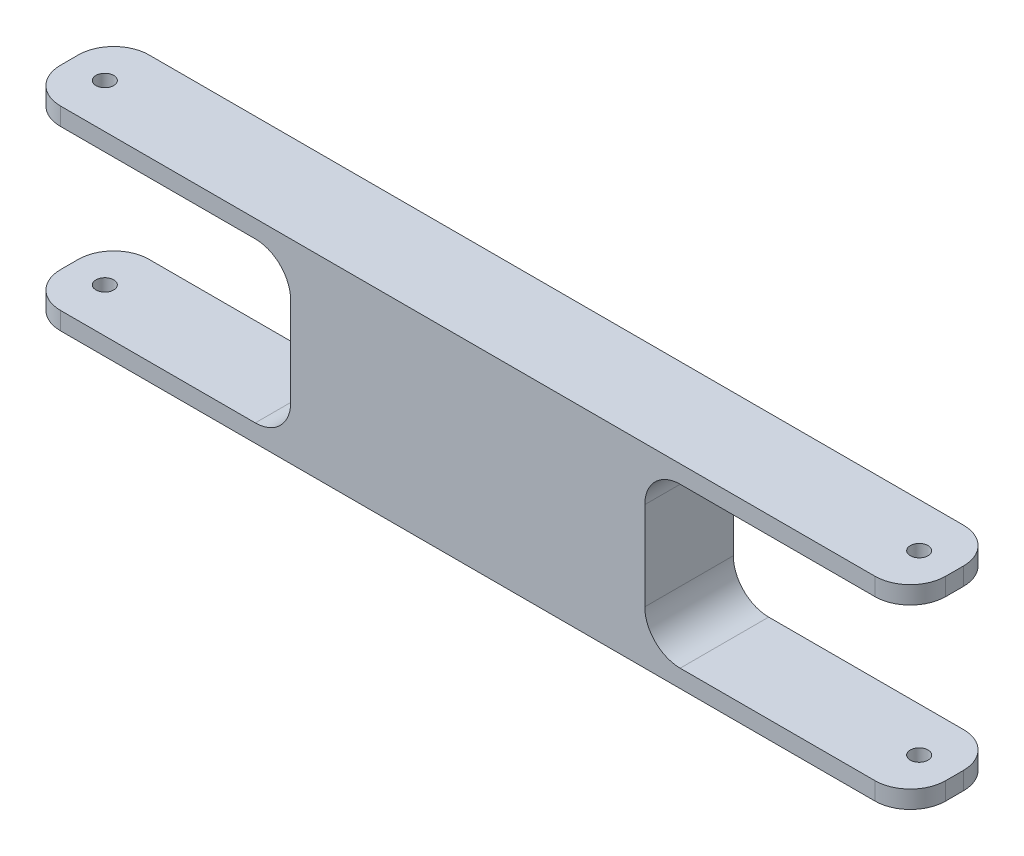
ISO-10303-21;
HEADER;
FILE_DESCRIPTION(('STEP AP214'),'2;1');
FILE_NAME('part.step','',(''),(''),'','','');
FILE_SCHEMA(('AUTOMOTIVE_DESIGN { 1 0 10303 214 1 1 1 1 }'));
ENDSEC;
DATA;
#1=APPLICATION_CONTEXT('core data for automotive mechanical design processes');
#2=APPLICATION_PROTOCOL_DEFINITION('international standard','automotive_design',2000,#1);
#3=PRODUCT_CONTEXT('',#1,'mechanical');
#4=PRODUCT('Part','Part','',(#3));
#5=PRODUCT_RELATED_PRODUCT_CATEGORY('part','',(#4));
#6=PRODUCT_DEFINITION_FORMATION('','',#4);
#7=PRODUCT_DEFINITION_CONTEXT('part definition',#1,'design');
#8=PRODUCT_DEFINITION('design','',#6,#7);
#9=PRODUCT_DEFINITION_SHAPE('','',#8);
#10=(LENGTH_UNIT() NAMED_UNIT(*) SI_UNIT(.MILLI.,.METRE.));
#11=(NAMED_UNIT(*) PLANE_ANGLE_UNIT() SI_UNIT($,.RADIAN.));
#12=(NAMED_UNIT(*) SI_UNIT($,.STERADIAN.) SOLID_ANGLE_UNIT());
#13=UNCERTAINTY_MEASURE_WITH_UNIT(LENGTH_MEASURE(1.E-05),#10,'distance_accuracy_value','');
#14=(GEOMETRIC_REPRESENTATION_CONTEXT(3) GLOBAL_UNCERTAINTY_ASSIGNED_CONTEXT((#13)) GLOBAL_UNIT_ASSIGNED_CONTEXT((#10,
#11,#12)) REPRESENTATION_CONTEXT('',''));
#15=CARTESIAN_POINT('',(0.,0.,0.));
#16=DIRECTION('',(0.,0.,1.));
#17=DIRECTION('',(1.,0.,0.));
#18=AXIS2_PLACEMENT_3D('',#15,#16,#17);
#19=CARTESIAN_POINT('',(-125.,-27.5,25.));
#20=DIRECTION('',(1.,0.,0.));
#21=DIRECTION('',(0.,0.,-1.));
#22=AXIS2_PLACEMENT_3D('',#19,#20,#21);
#23=PLANE('',#22);
#24=DIRECTION('',(0.,0.,1.));
#25=VECTOR('',#24,1.);
#26=CARTESIAN_POINT('',(-125.,22.5,-5.));
#27=LINE('',#26,#25);
#28=CARTESIAN_POINT('',(-125.,22.5,10.));
#29=VERTEX_POINT('',#28);
#30=CARTESIAN_POINT('',(-125.,22.5,15.));
#31=VERTEX_POINT('',#30);
#32=EDGE_CURVE('E249',#29,#31,#27,.T.);
#33=ORIENTED_EDGE('',*,*,#32,.T.);
#34=DIRECTION('',(0.,-1.,0.));
#35=VECTOR('',#34,1.);
#36=CARTESIAN_POINT('',(-125.,27.5,15.));
#37=LINE('',#36,#35);
#38=CARTESIAN_POINT('',(-125.,27.5,15.));
#39=VERTEX_POINT('',#38);
#40=EDGE_CURVE('E386',#31,#39,#37,.F.);
#41=ORIENTED_EDGE('',*,*,#40,.T.);
#42=DIRECTION('',(0.,0.,-1.));
#43=VECTOR('',#42,1.);
#44=CARTESIAN_POINT('',(-125.,27.5,25.));
#45=LINE('',#44,#43);
#46=CARTESIAN_POINT('',(-125.,27.5,10.));
#47=VERTEX_POINT('',#46);
#48=EDGE_CURVE('E266',#39,#47,#45,.T.);
#49=ORIENTED_EDGE('',*,*,#48,.T.);
#50=DIRECTION('',(0.,-1.,0.));
#51=VECTOR('',#50,1.);
#52=CARTESIAN_POINT('',(-125.,-27.5,10.));
#53=LINE('',#52,#51);
#54=EDGE_CURVE('E383',#47,#29,#53,.T.);
#55=ORIENTED_EDGE('',*,*,#54,.T.);
#56=EDGE_LOOP('',(#33,#41,#49,#55));
#57=FACE_BOUND('',#56,.T.);
#58=ADVANCED_FACE('F41',(#57),#23,.F.);
#59=CARTESIAN_POINT('',(125.,-27.5,25.));
#60=DIRECTION('',(-1.,0.,0.));
#61=DIRECTION('',(0.,0.,1.));
#62=AXIS2_PLACEMENT_3D('',#59,#60,#61);
#63=PLANE('',#62);
#64=DIRECTION('',(0.,0.,-1.));
#65=VECTOR('',#64,1.);
#66=CARTESIAN_POINT('',(125.,-27.5,25.));
#67=LINE('',#66,#65);
#68=CARTESIAN_POINT('',(125.,-27.5,15.));
#69=VERTEX_POINT('',#68);
#70=CARTESIAN_POINT('',(125.,-27.5,10.));
#71=VERTEX_POINT('',#70);
#72=EDGE_CURVE('E276',#69,#71,#67,.T.);
#73=ORIENTED_EDGE('',*,*,#72,.T.);
#74=DIRECTION('',(0.,1.,0.));
#75=VECTOR('',#74,1.);
#76=CARTESIAN_POINT('',(125.,-27.5,10.));
#77=LINE('',#76,#75);
#78=CARTESIAN_POINT('',(125.,-22.5,10.));
#79=VERTEX_POINT('',#78);
#80=EDGE_CURVE('E364',#71,#79,#77,.T.);
#81=ORIENTED_EDGE('',*,*,#80,.T.);
#82=DIRECTION('',(0.,0.,1.));
#83=VECTOR('',#82,1.);
#84=CARTESIAN_POINT('',(125.,-22.5,-5.));
#85=LINE('',#84,#83);
#86=CARTESIAN_POINT('',(125.,-22.5,15.));
#87=VERTEX_POINT('',#86);
#88=EDGE_CURVE('E237',#79,#87,#85,.T.);
#89=ORIENTED_EDGE('',*,*,#88,.T.);
#90=DIRECTION('',(0.,1.,0.));
#91=VECTOR('',#90,1.);
#92=CARTESIAN_POINT('',(125.,-27.5,15.));
#93=LINE('',#92,#91);
#94=EDGE_CURVE('E362',#87,#69,#93,.F.);
#95=ORIENTED_EDGE('',*,*,#94,.T.);
#96=EDGE_LOOP('',(#73,#81,#89,#95));
#97=FACE_BOUND('',#96,.T.);
#98=ADVANCED_FACE('F444',(#97),#63,.F.);
#99=DIRECTION('',(0.,0.,1.));
#100=VECTOR('',#99,1.);
#101=CARTESIAN_POINT('',(-125.,-22.5,-5.));
#102=LINE('',#101,#100);
#103=CARTESIAN_POINT('',(-125.,-22.5,10.));
#104=VERTEX_POINT('',#103);
#105=CARTESIAN_POINT('',(-125.,-22.5,15.));
#106=VERTEX_POINT('',#105);
#107=EDGE_CURVE('E246',#104,#106,#102,.T.);
#108=ORIENTED_EDGE('',*,*,#107,.F.);
#109=DIRECTION('',(0.,-1.,0.));
#110=VECTOR('',#109,1.);
#111=CARTESIAN_POINT('',(-125.,-27.5,10.));
#112=LINE('',#111,#110);
#113=CARTESIAN_POINT('',(-125.,-27.5,10.));
#114=VERTEX_POINT('',#113);
#115=EDGE_CURVE('E389',#104,#114,#112,.T.);
#116=ORIENTED_EDGE('',*,*,#115,.T.);
#117=DIRECTION('',(0.,0.,-1.));
#118=VECTOR('',#117,1.);
#119=CARTESIAN_POINT('',(-125.,-27.5,25.));
#120=LINE('',#119,#118);
#121=CARTESIAN_POINT('',(-125.,-27.5,15.));
#122=VERTEX_POINT('',#121);
#123=EDGE_CURVE('E279',#122,#114,#120,.T.);
#124=ORIENTED_EDGE('',*,*,#123,.F.);
#125=DIRECTION('',(0.,-1.,0.));
#126=VECTOR('',#125,1.);
#127=CARTESIAN_POINT('',(-125.,-22.5,15.));
#128=LINE('',#127,#126);
#129=EDGE_CURVE('E58',#122,#106,#128,.F.);
#130=ORIENTED_EDGE('',*,*,#129,.T.);
#131=EDGE_LOOP('',(#108,#116,#124,#130));
#132=FACE_BOUND('',#131,.T.);
#133=ADVANCED_FACE('F447',(#132),#23,.F.);
#134=CARTESIAN_POINT('',(125.,-27.5,25.));
#135=DIRECTION('',(0.,1.,0.));
#136=DIRECTION('',(-1.,0.,0.));
#137=AXIS2_PLACEMENT_3D('',#134,#135,#136);
#138=PLANE('',#137);
#139=CARTESIAN_POINT('',(115.,-27.5,12.5));
#140=DIRECTION('',(0.,-1.,0.));
#141=DIRECTION('',(1.,0.,0.));
#142=AXIS2_PLACEMENT_3D('',#139,#140,#141);
#143=CIRCLE('',#142,2.49999999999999);
#144=CARTESIAN_POINT('',(117.5,-27.5,12.5));
#145=VERTEX_POINT('',#144);
#146=EDGE_CURVE('E401',#145,#145,#143,.T.);
#147=ORIENTED_EDGE('',*,*,#146,.F.);
#148=EDGE_LOOP('',(#147));
#149=FACE_BOUND('',#148,.T.);
#150=CARTESIAN_POINT('',(-115.,-27.5,12.5));
#151=DIRECTION('',(0.,-1.,0.));
#152=DIRECTION('',(-1.,0.,0.));
#153=AXIS2_PLACEMENT_3D('',#150,#151,#152);
#154=CIRCLE('',#153,2.49999999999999);
#155=CARTESIAN_POINT('',(-117.5,-27.5,12.5));
#156=VERTEX_POINT('',#155);
#157=EDGE_CURVE('E406',#156,#156,#154,.T.);
#158=ORIENTED_EDGE('',*,*,#157,.F.);
#159=EDGE_LOOP('',(#158));
#160=FACE_BOUND('',#159,.T.);
#161=DIRECTION('',(1.,0.,0.));
#162=VECTOR('',#161,1.);
#163=CARTESIAN_POINT('',(125.,-27.5,0.));
#164=LINE('',#163,#162);
#165=CARTESIAN_POINT('',(-115.,-27.5,0.));
#166=VERTEX_POINT('',#165);
#167=CARTESIAN_POINT('',(115.,-27.5,0.));
#168=VERTEX_POINT('',#167);
#169=EDGE_CURVE('E244',#166,#168,#164,.T.);
#170=ORIENTED_EDGE('',*,*,#169,.T.);
#171=CARTESIAN_POINT('',(115.,-27.5,10.));
#172=DIRECTION('',(0.,1.,0.));
#173=DIRECTION('',(-1.,0.,0.));
#174=AXIS2_PLACEMENT_3D('',#171,#172,#173);
#175=CIRCLE('',#174,10.);
#176=EDGE_CURVE('E377',#168,#71,#175,.F.);
#177=ORIENTED_EDGE('',*,*,#176,.T.);
#178=ORIENTED_EDGE('',*,*,#72,.F.);
#179=CARTESIAN_POINT('',(115.,-27.5,15.));
#180=DIRECTION('',(0.,1.,0.));
#181=DIRECTION('',(-1.,0.,0.));
#182=AXIS2_PLACEMENT_3D('',#179,#180,#181);
#183=CIRCLE('',#182,10.);
#184=CARTESIAN_POINT('',(115.,-27.5,25.));
#185=VERTEX_POINT('',#184);
#186=EDGE_CURVE('E375',#69,#185,#183,.F.);
#187=ORIENTED_EDGE('',*,*,#186,.T.);
#188=DIRECTION('',(1.,0.,0.));
#189=VECTOR('',#188,1.);
#190=CARTESIAN_POINT('',(125.,-27.5,25.));
#191=LINE('',#190,#189);
#192=CARTESIAN_POINT('',(-115.,-27.5,25.));
#193=VERTEX_POINT('',#192);
#194=EDGE_CURVE('E260',#193,#185,#191,.T.);
#195=ORIENTED_EDGE('',*,*,#194,.F.);
#196=CARTESIAN_POINT('',(-115.,-27.5,15.));
#197=DIRECTION('',(0.,1.,0.));
#198=DIRECTION('',(-1.,0.,0.));
#199=AXIS2_PLACEMENT_3D('',#196,#197,#198);
#200=CIRCLE('',#199,10.);
#201=EDGE_CURVE('E371',#193,#122,#200,.F.);
#202=ORIENTED_EDGE('',*,*,#201,.T.);
#203=ORIENTED_EDGE('',*,*,#123,.T.);
#204=CARTESIAN_POINT('',(-115.,-27.5,10.));
#205=DIRECTION('',(0.,1.,0.));
#206=DIRECTION('',(-1.,0.,0.));
#207=AXIS2_PLACEMENT_3D('',#204,#205,#206);
#208=CIRCLE('',#207,10.);
#209=EDGE_CURVE('E373',#114,#166,#208,.F.);
#210=ORIENTED_EDGE('',*,*,#209,.T.);
#211=EDGE_LOOP('',(#170,#177,#178,#187,#195,#202,#203,#210));
#212=FACE_BOUND('',#211,.T.);
#213=ADVANCED_FACE('F458',(#149,#160,#212),#138,.F.);
#214=DIRECTION('',(0.,0.,1.));
#215=VECTOR('',#214,1.);
#216=CARTESIAN_POINT('',(125.,22.5,-5.));
#217=LINE('',#216,#215);
#218=CARTESIAN_POINT('',(125.,22.5,10.));
#219=VERTEX_POINT('',#218);
#220=CARTESIAN_POINT('',(125.,22.5,15.));
#221=VERTEX_POINT('',#220);
#222=EDGE_CURVE('E233',#219,#221,#217,.T.);
#223=ORIENTED_EDGE('',*,*,#222,.F.);
#224=DIRECTION('',(0.,1.,0.));
#225=VECTOR('',#224,1.);
#226=CARTESIAN_POINT('',(125.,-27.5,10.));
#227=LINE('',#226,#225);
#228=CARTESIAN_POINT('',(125.,27.5,10.));
#229=VERTEX_POINT('',#228);
#230=EDGE_CURVE('E329',#219,#229,#227,.T.);
#231=ORIENTED_EDGE('',*,*,#230,.T.);
#232=DIRECTION('',(0.,0.,-1.));
#233=VECTOR('',#232,1.);
#234=CARTESIAN_POINT('',(125.,27.5,25.));
#235=LINE('',#234,#233);
#236=CARTESIAN_POINT('',(125.,27.5,15.));
#237=VERTEX_POINT('',#236);
#238=EDGE_CURVE('E273',#237,#229,#235,.T.);
#239=ORIENTED_EDGE('',*,*,#238,.F.);
#240=DIRECTION('',(0.,1.,0.));
#241=VECTOR('',#240,1.);
#242=CARTESIAN_POINT('',(125.,22.5,15.));
#243=LINE('',#242,#241);
#244=EDGE_CURVE('E327',#237,#221,#243,.F.);
#245=ORIENTED_EDGE('',*,*,#244,.T.);
#246=EDGE_LOOP('',(#223,#231,#239,#245));
#247=FACE_BOUND('',#246,.T.);
#248=ADVANCED_FACE('F454',(#247),#63,.F.);
#249=CARTESIAN_POINT('',(125.,27.5,25.));
#250=DIRECTION('',(0.,-1.,0.));
#251=DIRECTION('',(1.,0.,0.));
#252=AXIS2_PLACEMENT_3D('',#249,#250,#251);
#253=PLANE('',#252);
#254=CARTESIAN_POINT('',(115.,27.5,12.5));
#255=DIRECTION('',(0.,-1.,0.));
#256=DIRECTION('',(1.,0.,0.));
#257=AXIS2_PLACEMENT_3D('',#254,#255,#256);
#258=CIRCLE('',#257,2.49999999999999);
#259=CARTESIAN_POINT('',(117.5,27.5,12.5));
#260=VERTEX_POINT('',#259);
#261=EDGE_CURVE('E395',#260,#260,#258,.T.);
#262=ORIENTED_EDGE('',*,*,#261,.T.);
#263=EDGE_LOOP('',(#262));
#264=FACE_BOUND('',#263,.T.);
#265=CARTESIAN_POINT('',(-115.,27.5,12.5));
#266=DIRECTION('',(0.,-1.,0.));
#267=DIRECTION('',(-1.,0.,0.));
#268=AXIS2_PLACEMENT_3D('',#265,#266,#267);
#269=CIRCLE('',#268,2.49999999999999);
#270=CARTESIAN_POINT('',(-117.5,27.5,12.5));
#271=VERTEX_POINT('',#270);
#272=EDGE_CURVE('E411',#271,#271,#269,.T.);
#273=ORIENTED_EDGE('',*,*,#272,.T.);
#274=EDGE_LOOP('',(#273));
#275=FACE_BOUND('',#274,.T.);
#276=ORIENTED_EDGE('',*,*,#238,.T.);
#277=CARTESIAN_POINT('',(115.,27.5,10.));
#278=DIRECTION('',(0.,-1.,0.));
#279=DIRECTION('',(1.,0.,0.));
#280=AXIS2_PLACEMENT_3D('',#277,#278,#279);
#281=CIRCLE('',#280,10.);
#282=CARTESIAN_POINT('',(115.,27.5,0.));
#283=VERTEX_POINT('',#282);
#284=EDGE_CURVE('E338',#229,#283,#281,.F.);
#285=ORIENTED_EDGE('',*,*,#284,.T.);
#286=DIRECTION('',(-1.,0.,0.));
#287=VECTOR('',#286,1.);
#288=CARTESIAN_POINT('',(125.,27.5,0.));
#289=LINE('',#288,#287);
#290=CARTESIAN_POINT('',(-115.,27.5,0.));
#291=VERTEX_POINT('',#290);
#292=EDGE_CURVE('E263',#283,#291,#289,.T.);
#293=ORIENTED_EDGE('',*,*,#292,.T.);
#294=CARTESIAN_POINT('',(-115.,27.5,10.));
#295=DIRECTION('',(0.,-1.,0.));
#296=DIRECTION('',(1.,0.,0.));
#297=AXIS2_PLACEMENT_3D('',#294,#295,#296);
#298=CIRCLE('',#297,10.);
#299=EDGE_CURVE('E332',#291,#47,#298,.F.);
#300=ORIENTED_EDGE('',*,*,#299,.T.);
#301=ORIENTED_EDGE('',*,*,#48,.F.);
#302=CARTESIAN_POINT('',(-115.,27.5,15.));
#303=DIRECTION('',(0.,-1.,0.));
#304=DIRECTION('',(1.,0.,0.));
#305=AXIS2_PLACEMENT_3D('',#302,#303,#304);
#306=CIRCLE('',#305,10.);
#307=CARTESIAN_POINT('',(-115.,27.5,25.));
#308=VERTEX_POINT('',#307);
#309=EDGE_CURVE('E334',#39,#308,#306,.F.);
#310=ORIENTED_EDGE('',*,*,#309,.T.);
#311=DIRECTION('',(-1.,0.,0.));
#312=VECTOR('',#311,1.);
#313=CARTESIAN_POINT('',(125.,27.5,25.));
#314=LINE('',#313,#312);
#315=CARTESIAN_POINT('',(115.,27.5,25.));
#316=VERTEX_POINT('',#315);
#317=EDGE_CURVE('E262',#316,#308,#314,.T.);
#318=ORIENTED_EDGE('',*,*,#317,.F.);
#319=CARTESIAN_POINT('',(115.,27.5,15.));
#320=DIRECTION('',(0.,-1.,0.));
#321=DIRECTION('',(1.,0.,0.));
#322=AXIS2_PLACEMENT_3D('',#319,#320,#321);
#323=CIRCLE('',#322,10.);
#324=EDGE_CURVE('E336',#316,#237,#323,.F.);
#325=ORIENTED_EDGE('',*,*,#324,.T.);
#326=EDGE_LOOP('',(#276,#285,#293,#300,#301,#310,#318,#325));
#327=FACE_BOUND('',#326,.T.);
#328=ADVANCED_FACE('F513',(#264,#275,#327),#253,.F.);
#329=CARTESIAN_POINT('',(0.,0.,25.));
#330=DIRECTION('',(0.,0.,1.));
#331=DIRECTION('',(1.,0.,0.));
#332=AXIS2_PLACEMENT_3D('',#329,#330,#331);
#333=PLANE('',#332);
#334=DIRECTION('',(-1.,0.,0.));
#335=VECTOR('',#334,1.);
#336=CARTESIAN_POINT('',(125.,22.5,25.));
#337=LINE('',#336,#335);
#338=CARTESIAN_POINT('',(115.,22.5,25.));
#339=VERTEX_POINT('',#338);
#340=CARTESIAN_POINT('',(60.,22.5,25.));
#341=VERTEX_POINT('',#340);
#342=EDGE_CURVE('E239',#339,#341,#337,.T.);
#343=ORIENTED_EDGE('',*,*,#342,.F.);
#344=DIRECTION('',(0.,1.,0.));
#345=VECTOR('',#344,1.);
#346=CARTESIAN_POINT('',(115.,27.5,25.));
#347=LINE('',#346,#345);
#348=EDGE_CURVE('E359',#339,#316,#347,.T.);
#349=ORIENTED_EDGE('',*,*,#348,.T.);
#350=ORIENTED_EDGE('',*,*,#317,.T.);
#351=DIRECTION('',(0.,-1.,0.));
#352=VECTOR('',#351,1.);
#353=CARTESIAN_POINT('',(-115.,22.5,25.));
#354=LINE('',#353,#352);
#355=CARTESIAN_POINT('',(-115.,22.5,25.));
#356=VERTEX_POINT('',#355);
#357=EDGE_CURVE('E355',#308,#356,#354,.T.);
#358=ORIENTED_EDGE('',*,*,#357,.T.);
#359=DIRECTION('',(-1.,0.,0.));
#360=VECTOR('',#359,1.);
#361=CARTESIAN_POINT('',(-125.,22.5,25.));
#362=LINE('',#361,#360);
#363=CARTESIAN_POINT('',(-60.,22.5,25.));
#364=VERTEX_POINT('',#363);
#365=EDGE_CURVE('E248',#364,#356,#362,.T.);
#366=ORIENTED_EDGE('',*,*,#365,.F.);
#367=CARTESIAN_POINT('',(-60.,12.5,25.));
#368=DIRECTION('',(0.,0.,1.));
#369=DIRECTION('',(1.,0.,0.));
#370=AXIS2_PLACEMENT_3D('',#367,#368,#369);
#371=CIRCLE('',#370,10.);
#372=CARTESIAN_POINT('',(-50.,12.5,25.));
#373=VERTEX_POINT('',#372);
#374=EDGE_CURVE('E323',#364,#373,#371,.F.);
#375=ORIENTED_EDGE('',*,*,#374,.T.);
#376=DIRECTION('',(0.,1.,0.));
#377=VECTOR('',#376,1.);
#378=CARTESIAN_POINT('',(-50.,22.5,25.));
#379=LINE('',#378,#377);
#380=CARTESIAN_POINT('',(-50.,-12.5,25.));
#381=VERTEX_POINT('',#380);
#382=EDGE_CURVE('E255',#381,#373,#379,.T.);
#383=ORIENTED_EDGE('',*,*,#382,.F.);
#384=CARTESIAN_POINT('',(-60.,-12.5,25.));
#385=DIRECTION('',(0.,0.,1.));
#386=DIRECTION('',(1.,0.,0.));
#387=AXIS2_PLACEMENT_3D('',#384,#385,#386);
#388=CIRCLE('',#387,10.);
#389=CARTESIAN_POINT('',(-60.,-22.5,25.));
#390=VERTEX_POINT('',#389);
#391=EDGE_CURVE('E313',#381,#390,#388,.F.);
#392=ORIENTED_EDGE('',*,*,#391,.T.);
#393=DIRECTION('',(1.,0.,0.));
#394=VECTOR('',#393,1.);
#395=CARTESIAN_POINT('',(-125.,-22.5,25.));
#396=LINE('',#395,#394);
#397=CARTESIAN_POINT('',(-115.,-22.5,25.));
#398=VERTEX_POINT('',#397);
#399=EDGE_CURVE('E258',#398,#390,#396,.T.);
#400=ORIENTED_EDGE('',*,*,#399,.F.);
#401=DIRECTION('',(0.,-1.,0.));
#402=VECTOR('',#401,1.);
#403=CARTESIAN_POINT('',(-115.,-27.5,25.));
#404=LINE('',#403,#402);
#405=EDGE_CURVE('E352',#398,#193,#404,.T.);
#406=ORIENTED_EDGE('',*,*,#405,.T.);
#407=ORIENTED_EDGE('',*,*,#194,.T.);
#408=DIRECTION('',(0.,1.,0.));
#409=VECTOR('',#408,1.);
#410=CARTESIAN_POINT('',(115.,-22.5,25.));
#411=LINE('',#410,#409);
#412=CARTESIAN_POINT('',(115.,-22.5,25.));
#413=VERTEX_POINT('',#412);
#414=EDGE_CURVE('E232',#185,#413,#411,.T.);
#415=ORIENTED_EDGE('',*,*,#414,.T.);
#416=DIRECTION('',(1.,0.,0.));
#417=VECTOR('',#416,1.);
#418=CARTESIAN_POINT('',(125.,-22.5,25.));
#419=LINE('',#418,#417);
#420=CARTESIAN_POINT('',(60.,-22.5,25.));
#421=VERTEX_POINT('',#420);
#422=EDGE_CURVE('E222',#421,#413,#419,.T.);
#423=ORIENTED_EDGE('',*,*,#422,.F.);
#424=CARTESIAN_POINT('',(60.,-12.5,25.));
#425=DIRECTION('',(0.,0.,1.));
#426=DIRECTION('',(1.,0.,0.));
#427=AXIS2_PLACEMENT_3D('',#424,#425,#426);
#428=CIRCLE('',#427,10.);
#429=CARTESIAN_POINT('',(50.,-12.5,25.));
#430=VERTEX_POINT('',#429);
#431=EDGE_CURVE('E204',#421,#430,#428,.F.);
#432=ORIENTED_EDGE('',*,*,#431,.T.);
#433=DIRECTION('',(0.,-1.,0.));
#434=VECTOR('',#433,1.);
#435=CARTESIAN_POINT('',(50.,22.5,25.));
#436=LINE('',#435,#434);
#437=CARTESIAN_POINT('',(50.,12.5,25.));
#438=VERTEX_POINT('',#437);
#439=EDGE_CURVE('E234',#438,#430,#436,.T.);
#440=ORIENTED_EDGE('',*,*,#439,.F.);
#441=CARTESIAN_POINT('',(60.,12.5,25.));
#442=DIRECTION('',(0.,0.,1.));
#443=DIRECTION('',(1.,0.,0.));
#444=AXIS2_PLACEMENT_3D('',#441,#442,#443);
#445=CIRCLE('',#444,10.);
#446=EDGE_CURVE('E318',#438,#341,#445,.F.);
#447=ORIENTED_EDGE('',*,*,#446,.T.);
#448=EDGE_LOOP('',(#343,#349,#350,#358,#366,#375,#383,#392,#400,#406,#407,#415,#423,#432,#440,#447));
#449=FACE_BOUND('',#448,.T.);
#450=ADVANCED_FACE('F229',(#449),#333,.T.);
#451=CARTESIAN_POINT('',(0.,0.,0.));
#452=DIRECTION('',(0.,0.,1.));
#453=DIRECTION('',(1.,0.,0.));
#454=AXIS2_PLACEMENT_3D('',#451,#452,#453);
#455=PLANE('',#454);
#456=ORIENTED_EDGE('',*,*,#292,.F.);
#457=DIRECTION('',(0.,1.,0.));
#458=VECTOR('',#457,1.);
#459=CARTESIAN_POINT('',(115.,0.,0.));
#460=LINE('',#459,#458);
#461=CARTESIAN_POINT('',(115.,22.5,0.));
#462=VERTEX_POINT('',#461);
#463=EDGE_CURVE('E346',#283,#462,#460,.F.);
#464=ORIENTED_EDGE('',*,*,#463,.T.);
#465=DIRECTION('',(-1.,0.,0.));
#466=VECTOR('',#465,1.);
#467=CARTESIAN_POINT('',(0.,22.5,0.));
#468=LINE('',#467,#466);
#469=CARTESIAN_POINT('',(60.,22.5,0.));
#470=VERTEX_POINT('',#469);
#471=EDGE_CURVE('E290',#462,#470,#468,.T.);
#472=ORIENTED_EDGE('',*,*,#471,.T.);
#473=CARTESIAN_POINT('',(60.,12.5,0.));
#474=DIRECTION('',(0.,0.,1.));
#475=DIRECTION('',(1.,0.,0.));
#476=AXIS2_PLACEMENT_3D('',#473,#474,#475);
#477=CIRCLE('',#476,10.);
#478=CARTESIAN_POINT('',(50.,12.5,0.));
#479=VERTEX_POINT('',#478);
#480=EDGE_CURVE('E321',#470,#479,#477,.T.);
#481=ORIENTED_EDGE('',*,*,#480,.T.);
#482=DIRECTION('',(0.,-1.,0.));
#483=VECTOR('',#482,1.);
#484=CARTESIAN_POINT('',(50.,0.,0.));
#485=LINE('',#484,#483);
#486=CARTESIAN_POINT('',(50.,-12.5,0.));
#487=VERTEX_POINT('',#486);
#488=EDGE_CURVE('E292',#479,#487,#485,.T.);
#489=ORIENTED_EDGE('',*,*,#488,.T.);
#490=CARTESIAN_POINT('',(60.,-12.5,0.));
#491=DIRECTION('',(0.,0.,1.));
#492=DIRECTION('',(1.,0.,0.));
#493=AXIS2_PLACEMENT_3D('',#490,#491,#492);
#494=CIRCLE('',#493,10.);
#495=CARTESIAN_POINT('',(60.,-22.5,0.));
#496=VERTEX_POINT('',#495);
#497=EDGE_CURVE('E214',#487,#496,#494,.T.);
#498=ORIENTED_EDGE('',*,*,#497,.T.);
#499=DIRECTION('',(1.,0.,0.));
#500=VECTOR('',#499,1.);
#501=CARTESIAN_POINT('',(0.,-22.5,0.));
#502=LINE('',#501,#500);
#503=CARTESIAN_POINT('',(115.,-22.5,0.));
#504=VERTEX_POINT('',#503);
#505=EDGE_CURVE('E224',#496,#504,#502,.T.);
#506=ORIENTED_EDGE('',*,*,#505,.T.);
#507=DIRECTION('',(0.,1.,0.));
#508=VECTOR('',#507,1.);
#509=CARTESIAN_POINT('',(115.,0.,0.));
#510=LINE('',#509,#508);
#511=EDGE_CURVE('E344',#504,#168,#510,.F.);
#512=ORIENTED_EDGE('',*,*,#511,.T.);
#513=ORIENTED_EDGE('',*,*,#169,.F.);
#514=DIRECTION('',(0.,-1.,0.));
#515=VECTOR('',#514,1.);
#516=CARTESIAN_POINT('',(-115.,0.,0.));
#517=LINE('',#516,#515);
#518=CARTESIAN_POINT('',(-115.,-22.5,0.));
#519=VERTEX_POINT('',#518);
#520=EDGE_CURVE('E340',#166,#519,#517,.F.);
#521=ORIENTED_EDGE('',*,*,#520,.T.);
#522=DIRECTION('',(1.,0.,0.));
#523=VECTOR('',#522,1.);
#524=CARTESIAN_POINT('',(0.,-22.5,0.));
#525=LINE('',#524,#523);
#526=CARTESIAN_POINT('',(-60.,-22.5,0.));
#527=VERTEX_POINT('',#526);
#528=EDGE_CURVE('E282',#519,#527,#525,.T.);
#529=ORIENTED_EDGE('',*,*,#528,.T.);
#530=CARTESIAN_POINT('',(-60.,-12.5,0.));
#531=DIRECTION('',(0.,0.,1.));
#532=DIRECTION('',(1.,0.,0.));
#533=AXIS2_PLACEMENT_3D('',#530,#531,#532);
#534=CIRCLE('',#533,10.);
#535=CARTESIAN_POINT('',(-50.,-12.5,0.));
#536=VERTEX_POINT('',#535);
#537=EDGE_CURVE('E316',#527,#536,#534,.T.);
#538=ORIENTED_EDGE('',*,*,#537,.T.);
#539=DIRECTION('',(0.,1.,0.));
#540=VECTOR('',#539,1.);
#541=CARTESIAN_POINT('',(-50.,0.,0.));
#542=LINE('',#541,#540);
#543=CARTESIAN_POINT('',(-50.,12.5,0.));
#544=VERTEX_POINT('',#543);
#545=EDGE_CURVE('E284',#536,#544,#542,.T.);
#546=ORIENTED_EDGE('',*,*,#545,.T.);
#547=CARTESIAN_POINT('',(-60.,12.5,0.));
#548=DIRECTION('',(0.,0.,1.));
#549=DIRECTION('',(1.,0.,0.));
#550=AXIS2_PLACEMENT_3D('',#547,#548,#549);
#551=CIRCLE('',#550,10.);
#552=CARTESIAN_POINT('',(-60.,22.5,0.));
#553=VERTEX_POINT('',#552);
#554=EDGE_CURVE('E325',#544,#553,#551,.T.);
#555=ORIENTED_EDGE('',*,*,#554,.T.);
#556=DIRECTION('',(-1.,0.,0.));
#557=VECTOR('',#556,1.);
#558=CARTESIAN_POINT('',(0.,22.5,0.));
#559=LINE('',#558,#557);
#560=CARTESIAN_POINT('',(-115.,22.5,0.));
#561=VERTEX_POINT('',#560);
#562=EDGE_CURVE('E287',#553,#561,#559,.T.);
#563=ORIENTED_EDGE('',*,*,#562,.T.);
#564=DIRECTION('',(0.,-1.,0.));
#565=VECTOR('',#564,1.);
#566=CARTESIAN_POINT('',(-115.,0.,0.));
#567=LINE('',#566,#565);
#568=EDGE_CURVE('E342',#561,#291,#567,.F.);
#569=ORIENTED_EDGE('',*,*,#568,.T.);
#570=EDGE_LOOP('',(#456,#464,#472,#481,#489,#498,#506,#512,#513,#521,#529,#538,#546,#555,#563,#569));
#571=FACE_BOUND('',#570,.T.);
#572=ADVANCED_FACE('F428',(#571),#455,.F.);
#573=CARTESIAN_POINT('',(-125.,22.5,-5.));
#574=DIRECTION('',(0.,1.,0.));
#575=DIRECTION('',(-1.,0.,0.));
#576=AXIS2_PLACEMENT_3D('',#573,#574,#575);
#577=PLANE('',#576);
#578=CARTESIAN_POINT('',(-115.,22.5,12.5));
#579=DIRECTION('',(0.,1.,0.));
#580=DIRECTION('',(-1.,0.,0.));
#581=AXIS2_PLACEMENT_3D('',#578,#579,#580);
#582=CIRCLE('',#581,2.49999999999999);
#583=CARTESIAN_POINT('',(-117.5,22.5,12.5));
#584=VERTEX_POINT('',#583);
#585=EDGE_CURVE('E252',#584,#584,#582,.T.);
#586=ORIENTED_EDGE('',*,*,#585,.T.);
#587=EDGE_LOOP('',(#586));
#588=FACE_BOUND('',#587,.T.);
#589=ORIENTED_EDGE('',*,*,#365,.T.);
#590=CARTESIAN_POINT('',(-115.,22.5,15.));
#591=DIRECTION('',(0.,1.,0.));
#592=DIRECTION('',(-1.,0.,0.));
#593=AXIS2_PLACEMENT_3D('',#590,#591,#592);
#594=CIRCLE('',#593,10.);
#595=EDGE_CURVE('E381',#356,#31,#594,.F.);
#596=ORIENTED_EDGE('',*,*,#595,.T.);
#597=ORIENTED_EDGE('',*,*,#32,.F.);
#598=CARTESIAN_POINT('',(-115.,22.5,10.));
#599=DIRECTION('',(0.,1.,0.));
#600=DIRECTION('',(-1.,0.,0.));
#601=AXIS2_PLACEMENT_3D('',#598,#599,#600);
#602=CIRCLE('',#601,10.);
#603=EDGE_CURVE('E379',#29,#561,#602,.F.);
#604=ORIENTED_EDGE('',*,*,#603,.T.);
#605=ORIENTED_EDGE('',*,*,#562,.F.);
#606=DIRECTION('',(0.,0.,1.));
#607=VECTOR('',#606,1.);
#608=CARTESIAN_POINT('',(-60.,22.5,25.));
#609=LINE('',#608,#607);
#610=EDGE_CURVE('E215',#553,#364,#609,.T.);
#611=ORIENTED_EDGE('',*,*,#610,.T.);
#612=EDGE_LOOP('',(#589,#596,#597,#604,#605,#611));
#613=FACE_BOUND('',#612,.T.);
#614=ADVANCED_FACE('F502',(#588,#613),#577,.F.);
#615=CARTESIAN_POINT('',(-50.,22.5,-5.));
#616=DIRECTION('',(1.,0.,0.));
#617=DIRECTION('',(0.,1.,0.));
#618=AXIS2_PLACEMENT_3D('',#615,#616,#617);
#619=PLANE('',#618);
#620=ORIENTED_EDGE('',*,*,#545,.F.);
#621=DIRECTION('',(0.,0.,1.));
#622=VECTOR('',#621,1.);
#623=CARTESIAN_POINT('',(-50.,-12.5,25.));
#624=LINE('',#623,#622);
#625=EDGE_CURVE('E301',#536,#381,#624,.T.);
#626=ORIENTED_EDGE('',*,*,#625,.T.);
#627=ORIENTED_EDGE('',*,*,#382,.T.);
#628=DIRECTION('',(0.,0.,1.));
#629=VECTOR('',#628,1.);
#630=CARTESIAN_POINT('',(-50.,12.5,0.));
#631=LINE('',#630,#629);
#632=EDGE_CURVE('E299',#373,#544,#631,.F.);
#633=ORIENTED_EDGE('',*,*,#632,.T.);
#634=EDGE_LOOP('',(#620,#626,#627,#633));
#635=FACE_BOUND('',#634,.T.);
#636=ADVANCED_FACE('F494',(#635),#619,.F.);
#637=CARTESIAN_POINT('',(-125.,-22.5,-5.));
#638=DIRECTION('',(0.,-1.,0.));
#639=DIRECTION('',(0.,0.,-1.));
#640=AXIS2_PLACEMENT_3D('',#637,#638,#639);
#641=PLANE('',#640);
#642=CARTESIAN_POINT('',(-115.,-22.5,12.5));
#643=DIRECTION('',(0.,-1.,0.));
#644=DIRECTION('',(0.,0.,-1.));
#645=AXIS2_PLACEMENT_3D('',#642,#643,#644);
#646=CIRCLE('',#645,2.49999999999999);
#647=CARTESIAN_POINT('',(-115.,-22.5,9.99999999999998));
#648=VERTEX_POINT('',#647);
#649=EDGE_CURVE('E45',#648,#648,#646,.T.);
#650=ORIENTED_EDGE('',*,*,#649,.T.);
#651=EDGE_LOOP('',(#650));
#652=FACE_BOUND('',#651,.T.);
#653=ORIENTED_EDGE('',*,*,#528,.F.);
#654=CARTESIAN_POINT('',(-115.,-22.5,10.));
#655=DIRECTION('',(0.,-1.,0.));
#656=DIRECTION('',(0.,0.,-1.));
#657=AXIS2_PLACEMENT_3D('',#654,#655,#656);
#658=CIRCLE('',#657,10.);
#659=EDGE_CURVE('E11',#519,#104,#658,.F.);
#660=ORIENTED_EDGE('',*,*,#659,.T.);
#661=ORIENTED_EDGE('',*,*,#107,.T.);
#662=CARTESIAN_POINT('',(-115.,-22.5,15.));
#663=DIRECTION('',(0.,-1.,0.));
#664=DIRECTION('',(0.,0.,-1.));
#665=AXIS2_PLACEMENT_3D('',#662,#663,#664);
#666=CIRCLE('',#665,10.);
#667=EDGE_CURVE('E50',#106,#398,#666,.F.);
#668=ORIENTED_EDGE('',*,*,#667,.T.);
#669=ORIENTED_EDGE('',*,*,#399,.T.);
#670=DIRECTION('',(0.,0.,1.));
#671=VECTOR('',#670,1.);
#672=CARTESIAN_POINT('',(-60.,-22.5,0.));
#673=LINE('',#672,#671);
#674=EDGE_CURVE('E304',#390,#527,#673,.F.);
#675=ORIENTED_EDGE('',*,*,#674,.T.);
#676=EDGE_LOOP('',(#653,#660,#661,#668,#669,#675));
#677=FACE_BOUND('',#676,.T.);
#678=ADVANCED_FACE('F440',(#652,#677),#641,.F.);
#679=CARTESIAN_POINT('',(125.,-22.5,-5.));
#680=DIRECTION('',(0.,-1.,0.));
#681=DIRECTION('',(1.,0.,0.));
#682=AXIS2_PLACEMENT_3D('',#679,#680,#681);
#683=PLANE('',#682);
#684=CARTESIAN_POINT('',(115.,-22.5,12.5));
#685=DIRECTION('',(0.,-1.,0.));
#686=DIRECTION('',(1.,0.,0.));
#687=AXIS2_PLACEMENT_3D('',#684,#685,#686);
#688=CIRCLE('',#687,2.49999999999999);
#689=CARTESIAN_POINT('',(117.5,-22.5,12.5));
#690=VERTEX_POINT('',#689);
#691=EDGE_CURVE('E394',#690,#690,#688,.T.);
#692=ORIENTED_EDGE('',*,*,#691,.T.);
#693=EDGE_LOOP('',(#692));
#694=FACE_BOUND('',#693,.T.);
#695=ORIENTED_EDGE('',*,*,#88,.F.);
#696=CARTESIAN_POINT('',(115.,-22.5,10.));
#697=DIRECTION('',(0.,-1.,0.));
#698=DIRECTION('',(1.,0.,0.));
#699=AXIS2_PLACEMENT_3D('',#696,#697,#698);
#700=CIRCLE('',#699,10.);
#701=EDGE_CURVE('E369',#79,#504,#700,.F.);
#702=ORIENTED_EDGE('',*,*,#701,.T.);
#703=ORIENTED_EDGE('',*,*,#505,.F.);
#704=DIRECTION('',(0.,0.,1.));
#705=VECTOR('',#704,1.);
#706=CARTESIAN_POINT('',(60.,-22.5,25.));
#707=LINE('',#706,#705);
#708=EDGE_CURVE('E208',#496,#421,#707,.T.);
#709=ORIENTED_EDGE('',*,*,#708,.T.);
#710=ORIENTED_EDGE('',*,*,#422,.T.);
#711=CARTESIAN_POINT('',(115.,-22.5,15.));
#712=DIRECTION('',(0.,-1.,0.));
#713=DIRECTION('',(1.,0.,0.));
#714=AXIS2_PLACEMENT_3D('',#711,#712,#713);
#715=CIRCLE('',#714,10.);
#716=EDGE_CURVE('E367',#413,#87,#715,.F.);
#717=ORIENTED_EDGE('',*,*,#716,.T.);
#718=EDGE_LOOP('',(#695,#702,#703,#709,#710,#717));
#719=FACE_BOUND('',#718,.T.);
#720=ADVANCED_FACE('F221',(#694,#719),#683,.F.);
#721=CARTESIAN_POINT('',(50.,22.5,-5.));
#722=DIRECTION('',(-1.,0.,0.));
#723=DIRECTION('',(0.,0.,1.));
#724=AXIS2_PLACEMENT_3D('',#721,#722,#723);
#725=PLANE('',#724);
#726=ORIENTED_EDGE('',*,*,#439,.T.);
#727=DIRECTION('',(0.,0.,1.));
#728=VECTOR('',#727,1.);
#729=CARTESIAN_POINT('',(50.,-12.5,0.));
#730=LINE('',#729,#728);
#731=EDGE_CURVE('E209',#430,#487,#730,.F.);
#732=ORIENTED_EDGE('',*,*,#731,.T.);
#733=ORIENTED_EDGE('',*,*,#488,.F.);
#734=DIRECTION('',(0.,0.,1.));
#735=VECTOR('',#734,1.);
#736=CARTESIAN_POINT('',(50.,12.5,25.));
#737=LINE('',#736,#735);
#738=EDGE_CURVE('E225',#479,#438,#737,.T.);
#739=ORIENTED_EDGE('',*,*,#738,.T.);
#740=EDGE_LOOP('',(#726,#732,#733,#739));
#741=FACE_BOUND('',#740,.T.);
#742=ADVANCED_FACE('F430',(#741),#725,.F.);
#743=CARTESIAN_POINT('',(125.,22.5,-5.));
#744=DIRECTION('',(0.,1.,0.));
#745=DIRECTION('',(-1.,0.,0.));
#746=AXIS2_PLACEMENT_3D('',#743,#744,#745);
#747=PLANE('',#746);
#748=CARTESIAN_POINT('',(115.,22.5,12.5));
#749=DIRECTION('',(0.,1.,0.));
#750=DIRECTION('',(-1.,0.,0.));
#751=AXIS2_PLACEMENT_3D('',#748,#749,#750);
#752=CIRCLE('',#751,2.49999999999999);
#753=CARTESIAN_POINT('',(112.5,22.5,12.5));
#754=VERTEX_POINT('',#753);
#755=EDGE_CURVE('E392',#754,#754,#752,.T.);
#756=ORIENTED_EDGE('',*,*,#755,.T.);
#757=EDGE_LOOP('',(#756));
#758=FACE_BOUND('',#757,.T.);
#759=ORIENTED_EDGE('',*,*,#471,.F.);
#760=CARTESIAN_POINT('',(115.,22.5,10.));
#761=DIRECTION('',(0.,1.,0.));
#762=DIRECTION('',(-1.,0.,0.));
#763=AXIS2_PLACEMENT_3D('',#760,#761,#762);
#764=CIRCLE('',#763,10.);
#765=EDGE_CURVE('E350',#462,#219,#764,.F.);
#766=ORIENTED_EDGE('',*,*,#765,.T.);
#767=ORIENTED_EDGE('',*,*,#222,.T.);
#768=CARTESIAN_POINT('',(115.,22.5,15.));
#769=DIRECTION('',(0.,1.,0.));
#770=DIRECTION('',(-1.,0.,0.));
#771=AXIS2_PLACEMENT_3D('',#768,#769,#770);
#772=CIRCLE('',#771,10.);
#773=EDGE_CURVE('E348',#221,#339,#772,.F.);
#774=ORIENTED_EDGE('',*,*,#773,.T.);
#775=ORIENTED_EDGE('',*,*,#342,.T.);
#776=DIRECTION('',(0.,0.,1.));
#777=VECTOR('',#776,1.);
#778=CARTESIAN_POINT('',(60.,22.5,0.));
#779=LINE('',#778,#777);
#780=EDGE_CURVE('E307',#341,#470,#779,.F.);
#781=ORIENTED_EDGE('',*,*,#780,.T.);
#782=EDGE_LOOP('',(#759,#766,#767,#774,#775,#781));
#783=FACE_BOUND('',#782,.T.);
#784=ADVANCED_FACE('F417',(#758,#783),#747,.F.);
#785=CARTESIAN_POINT('',(60.,-12.5,-5.));
#786=DIRECTION('',(0.,0.,-1.));
#787=DIRECTION('',(-1.,0.,0.));
#788=AXIS2_PLACEMENT_3D('',#785,#786,#787);
#789=CYLINDRICAL_SURFACE('',#788,10.);
#790=ORIENTED_EDGE('',*,*,#497,.F.);
#791=ORIENTED_EDGE('',*,*,#731,.F.);
#792=ORIENTED_EDGE('',*,*,#431,.F.);
#793=ORIENTED_EDGE('',*,*,#708,.F.);
#794=EDGE_LOOP('',(#790,#791,#792,#793));
#795=FACE_BOUND('',#794,.T.);
#796=ADVANCED_FACE('F207',(#795),#789,.F.);
#797=CARTESIAN_POINT('',(-60.,-12.5,-5.));
#798=DIRECTION('',(0.,0.,-1.));
#799=DIRECTION('',(-1.,0.,0.));
#800=AXIS2_PLACEMENT_3D('',#797,#798,#799);
#801=CYLINDRICAL_SURFACE('',#800,10.);
#802=ORIENTED_EDGE('',*,*,#537,.F.);
#803=ORIENTED_EDGE('',*,*,#674,.F.);
#804=ORIENTED_EDGE('',*,*,#391,.F.);
#805=ORIENTED_EDGE('',*,*,#625,.F.);
#806=EDGE_LOOP('',(#802,#803,#804,#805));
#807=FACE_BOUND('',#806,.T.);
#808=ADVANCED_FACE('F490',(#807),#801,.F.);
#809=CARTESIAN_POINT('',(60.,12.5,-5.));
#810=DIRECTION('',(0.,0.,-1.));
#811=DIRECTION('',(-1.,0.,0.));
#812=AXIS2_PLACEMENT_3D('',#809,#810,#811);
#813=CYLINDRICAL_SURFACE('',#812,10.);
#814=ORIENTED_EDGE('',*,*,#480,.F.);
#815=ORIENTED_EDGE('',*,*,#780,.F.);
#816=ORIENTED_EDGE('',*,*,#446,.F.);
#817=ORIENTED_EDGE('',*,*,#738,.F.);
#818=EDGE_LOOP('',(#814,#815,#816,#817));
#819=FACE_BOUND('',#818,.T.);
#820=ADVANCED_FACE('F424',(#819),#813,.F.);
#821=CARTESIAN_POINT('',(-60.,12.5,-5.));
#822=DIRECTION('',(0.,0.,-1.));
#823=DIRECTION('',(-1.,0.,0.));
#824=AXIS2_PLACEMENT_3D('',#821,#822,#823);
#825=CYLINDRICAL_SURFACE('',#824,10.);
#826=ORIENTED_EDGE('',*,*,#554,.F.);
#827=ORIENTED_EDGE('',*,*,#632,.F.);
#828=ORIENTED_EDGE('',*,*,#374,.F.);
#829=ORIENTED_EDGE('',*,*,#610,.F.);
#830=EDGE_LOOP('',(#826,#827,#828,#829));
#831=FACE_BOUND('',#830,.T.);
#832=ADVANCED_FACE('F497',(#831),#825,.F.);
#833=CARTESIAN_POINT('',(115.,-27.5,10.));
#834=DIRECTION('',(0.,1.,0.));
#835=DIRECTION('',(0.,0.,1.));
#836=AXIS2_PLACEMENT_3D('',#833,#834,#835);
#837=CYLINDRICAL_SURFACE('',#836,10.);
#838=ORIENTED_EDGE('',*,*,#765,.F.);
#839=ORIENTED_EDGE('',*,*,#463,.F.);
#840=ORIENTED_EDGE('',*,*,#284,.F.);
#841=ORIENTED_EDGE('',*,*,#230,.F.);
#842=EDGE_LOOP('',(#838,#839,#840,#841));
#843=FACE_BOUND('',#842,.T.);
#844=ADVANCED_FACE('F526',(#843),#837,.T.);
#845=CARTESIAN_POINT('',(115.,0.,15.));
#846=DIRECTION('',(0.,-1.,0.));
#847=DIRECTION('',(0.,0.,-1.));
#848=AXIS2_PLACEMENT_3D('',#845,#846,#847);
#849=CYLINDRICAL_SURFACE('',#848,10.);
#850=ORIENTED_EDGE('',*,*,#773,.F.);
#851=ORIENTED_EDGE('',*,*,#244,.F.);
#852=ORIENTED_EDGE('',*,*,#324,.F.);
#853=ORIENTED_EDGE('',*,*,#348,.F.);
#854=EDGE_LOOP('',(#850,#851,#852,#853));
#855=FACE_BOUND('',#854,.T.);
#856=ADVANCED_FACE('F524',(#855),#849,.T.);
#857=CARTESIAN_POINT('',(115.,-27.5,10.));
#858=DIRECTION('',(0.,1.,0.));
#859=DIRECTION('',(0.,0.,1.));
#860=AXIS2_PLACEMENT_3D('',#857,#858,#859);
#861=CYLINDRICAL_SURFACE('',#860,10.);
#862=ORIENTED_EDGE('',*,*,#176,.F.);
#863=ORIENTED_EDGE('',*,*,#511,.F.);
#864=ORIENTED_EDGE('',*,*,#701,.F.);
#865=ORIENTED_EDGE('',*,*,#80,.F.);
#866=EDGE_LOOP('',(#862,#863,#864,#865));
#867=FACE_BOUND('',#866,.T.);
#868=ADVANCED_FACE('F474',(#867),#861,.T.);
#869=CARTESIAN_POINT('',(115.,0.,15.));
#870=DIRECTION('',(0.,-1.,0.));
#871=DIRECTION('',(0.,0.,-1.));
#872=AXIS2_PLACEMENT_3D('',#869,#870,#871);
#873=CYLINDRICAL_SURFACE('',#872,10.);
#874=ORIENTED_EDGE('',*,*,#186,.F.);
#875=ORIENTED_EDGE('',*,*,#94,.F.);
#876=ORIENTED_EDGE('',*,*,#716,.F.);
#877=ORIENTED_EDGE('',*,*,#414,.F.);
#878=EDGE_LOOP('',(#874,#875,#876,#877));
#879=FACE_BOUND('',#878,.T.);
#880=ADVANCED_FACE('F480',(#879),#873,.T.);
#881=CARTESIAN_POINT('',(-115.,0.,15.));
#882=DIRECTION('',(0.,1.,0.));
#883=DIRECTION('',(0.,0.,1.));
#884=AXIS2_PLACEMENT_3D('',#881,#882,#883);
#885=CYLINDRICAL_SURFACE('',#884,10.);
#886=ORIENTED_EDGE('',*,*,#309,.F.);
#887=ORIENTED_EDGE('',*,*,#40,.F.);
#888=ORIENTED_EDGE('',*,*,#595,.F.);
#889=ORIENTED_EDGE('',*,*,#357,.F.);
#890=EDGE_LOOP('',(#886,#887,#888,#889));
#891=FACE_BOUND('',#890,.T.);
#892=ADVANCED_FACE('F517',(#891),#885,.T.);
#893=CARTESIAN_POINT('',(-115.,-27.5,10.));
#894=DIRECTION('',(0.,-1.,0.));
#895=DIRECTION('',(0.,0.,-1.));
#896=AXIS2_PLACEMENT_3D('',#893,#894,#895);
#897=CYLINDRICAL_SURFACE('',#896,10.);
#898=ORIENTED_EDGE('',*,*,#299,.F.);
#899=ORIENTED_EDGE('',*,*,#568,.F.);
#900=ORIENTED_EDGE('',*,*,#603,.F.);
#901=ORIENTED_EDGE('',*,*,#54,.F.);
#902=EDGE_LOOP('',(#898,#899,#900,#901));
#903=FACE_BOUND('',#902,.T.);
#904=ADVANCED_FACE('F508',(#903),#897,.T.);
#905=CARTESIAN_POINT('',(-115.,-27.5,10.));
#906=DIRECTION('',(0.,-1.,0.));
#907=DIRECTION('',(0.,0.,-1.));
#908=AXIS2_PLACEMENT_3D('',#905,#906,#907);
#909=CYLINDRICAL_SURFACE('',#908,10.);
#910=ORIENTED_EDGE('',*,*,#659,.F.);
#911=ORIENTED_EDGE('',*,*,#520,.F.);
#912=ORIENTED_EDGE('',*,*,#209,.F.);
#913=ORIENTED_EDGE('',*,*,#115,.F.);
#914=EDGE_LOOP('',(#910,#911,#912,#913));
#915=FACE_BOUND('',#914,.T.);
#916=ADVANCED_FACE('F467',(#915),#909,.T.);
#917=CARTESIAN_POINT('',(-115.,0.,15.));
#918=DIRECTION('',(0.,1.,0.));
#919=DIRECTION('',(0.,0.,1.));
#920=AXIS2_PLACEMENT_3D('',#917,#918,#919);
#921=CYLINDRICAL_SURFACE('',#920,10.);
#922=ORIENTED_EDGE('',*,*,#667,.F.);
#923=ORIENTED_EDGE('',*,*,#129,.F.);
#924=ORIENTED_EDGE('',*,*,#201,.F.);
#925=ORIENTED_EDGE('',*,*,#405,.F.);
#926=EDGE_LOOP('',(#922,#923,#924,#925));
#927=FACE_BOUND('',#926,.T.);
#928=ADVANCED_FACE('F43',(#927),#921,.T.);
#929=CARTESIAN_POINT('',(115.,27.5,12.5));
#930=DIRECTION('',(0.,-1.,0.));
#931=DIRECTION('',(1.,0.,0.));
#932=AXIS2_PLACEMENT_3D('',#929,#930,#931);
#933=CYLINDRICAL_SURFACE('',#932,2.49999999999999);
#934=ORIENTED_EDGE('',*,*,#261,.F.);
#935=EDGE_LOOP('',(#934));
#936=FACE_BOUND('',#935,.T.);
#937=ORIENTED_EDGE('',*,*,#755,.F.);
#938=EDGE_LOOP('',(#937));
#939=FACE_BOUND('',#938,.T.);
#940=ADVANCED_FACE('F546',(#936,#939),#933,.F.);
#941=ORIENTED_EDGE('',*,*,#146,.T.);
#942=EDGE_LOOP('',(#941));
#943=FACE_BOUND('',#942,.T.);
#944=ORIENTED_EDGE('',*,*,#691,.F.);
#945=EDGE_LOOP('',(#944));
#946=FACE_BOUND('',#945,.T.);
#947=ADVANCED_FACE('F550',(#943,#946),#933,.F.);
#948=CARTESIAN_POINT('',(-115.,27.5,12.5));
#949=DIRECTION('',(0.,-1.,0.));
#950=DIRECTION('',(1.,0.,0.));
#951=AXIS2_PLACEMENT_3D('',#948,#949,#950);
#952=CYLINDRICAL_SURFACE('',#951,2.49999999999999);
#953=ORIENTED_EDGE('',*,*,#157,.T.);
#954=EDGE_LOOP('',(#953));
#955=FACE_BOUND('',#954,.T.);
#956=ORIENTED_EDGE('',*,*,#649,.F.);
#957=EDGE_LOOP('',(#956));
#958=FACE_BOUND('',#957,.T.);
#959=ADVANCED_FACE('F556',(#955,#958),#952,.F.);
#960=ORIENTED_EDGE('',*,*,#272,.F.);
#961=EDGE_LOOP('',(#960));
#962=FACE_BOUND('',#961,.T.);
#963=ORIENTED_EDGE('',*,*,#585,.F.);
#964=EDGE_LOOP('',(#963));
#965=FACE_BOUND('',#964,.T.);
#966=ADVANCED_FACE('F560',(#962,#965),#952,.F.);
#967=CLOSED_SHELL('',(#58,#98,#133,#213,#248,#328,#450,#572,#614,#636,#678,#720,#742,#784,#796,
#808,#820,#832,#844,#856,#868,#880,#892,#904,#916,#928,#940,#947,#959,#966));
#968=MANIFOLD_SOLID_BREP('B2',#967);
#969=ADVANCED_BREP_SHAPE_REPRESENTATION('',(#18,#968),#14);
#970=SHAPE_DEFINITION_REPRESENTATION(#9,#969);
ENDSEC;
END-ISO-10303-21;
